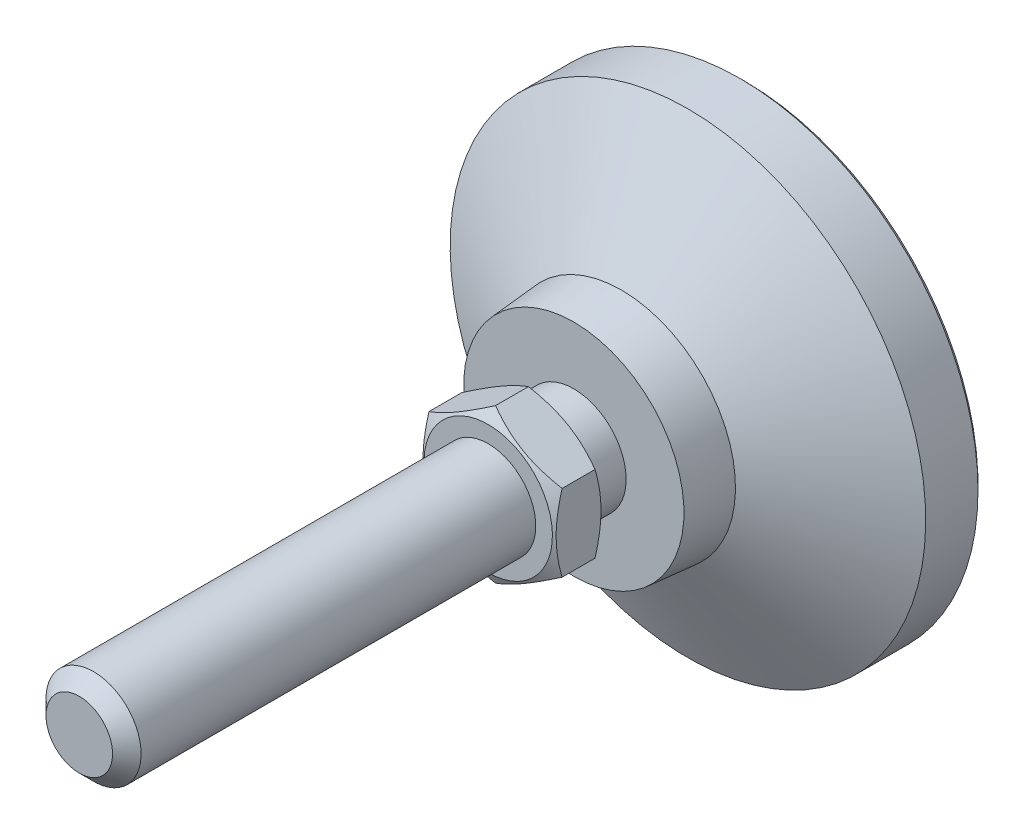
ISO-10303-21;
HEADER;
FILE_DESCRIPTION(('STEP AP214'),'2;1');
FILE_NAME('part.step','',(''),(''),'','','');
FILE_SCHEMA(('AUTOMOTIVE_DESIGN { 1 0 10303 214 1 1 1 1 }'));
ENDSEC;
DATA;
#1=APPLICATION_CONTEXT('core data for automotive mechanical design processes');
#2=APPLICATION_PROTOCOL_DEFINITION('international standard','automotive_design',2000,#1);
#3=PRODUCT_CONTEXT('',#1,'mechanical');
#4=PRODUCT('Part','Part','',(#3));
#5=PRODUCT_RELATED_PRODUCT_CATEGORY('part','',(#4));
#6=PRODUCT_DEFINITION_FORMATION('','',#4);
#7=PRODUCT_DEFINITION_CONTEXT('part definition',#1,'design');
#8=PRODUCT_DEFINITION('design','',#6,#7);
#9=PRODUCT_DEFINITION_SHAPE('','',#8);
#10=(LENGTH_UNIT() NAMED_UNIT(*) SI_UNIT(.MILLI.,.METRE.));
#11=(NAMED_UNIT(*) PLANE_ANGLE_UNIT() SI_UNIT($,.RADIAN.));
#12=(NAMED_UNIT(*) SI_UNIT($,.STERADIAN.) SOLID_ANGLE_UNIT());
#13=UNCERTAINTY_MEASURE_WITH_UNIT(LENGTH_MEASURE(1.E-05),#10,'distance_accuracy_value','');
#14=(GEOMETRIC_REPRESENTATION_CONTEXT(3) GLOBAL_UNCERTAINTY_ASSIGNED_CONTEXT((#13)) GLOBAL_UNIT_ASSIGNED_CONTEXT((#10,
#11,#12)) REPRESENTATION_CONTEXT('',''));
#15=CARTESIAN_POINT('',(0.,0.,0.));
#16=DIRECTION('',(0.,0.,1.));
#17=DIRECTION('',(1.,0.,0.));
#18=AXIS2_PLACEMENT_3D('',#15,#16,#17);
#19=CARTESIAN_POINT('',(0.,0.,-1.));
#20=DIRECTION('',(0.,0.,-1.));
#21=DIRECTION('',(0.,1.,0.));
#22=AXIS2_PLACEMENT_3D('',#19,#20,#21);
#23=CYLINDRICAL_SURFACE('',#22,5.50000000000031);
#24=CARTESIAN_POINT('',(0.,0.,22.));
#25=DIRECTION('',(0.,0.,-1.));
#26=DIRECTION('',(0.,1.,0.));
#27=AXIS2_PLACEMENT_3D('',#24,#25,#26);
#28=CIRCLE('',#27,5.50000000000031);
#29=CARTESIAN_POINT('',(0.,5.50000000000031,22.));
#30=VERTEX_POINT('',#29);
#31=EDGE_CURVE('E106',#30,#30,#28,.T.);
#32=ORIENTED_EDGE('',*,*,#31,.T.);
#33=EDGE_LOOP('',(#32));
#34=FACE_BOUND('',#33,.T.);
#35=CARTESIAN_POINT('',(0.,0.,18.));
#36=DIRECTION('',(0.,0.,-1.));
#37=DIRECTION('',(0.,1.,0.));
#38=AXIS2_PLACEMENT_3D('',#35,#36,#37);
#39=CIRCLE('',#38,5.50000000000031);
#40=CARTESIAN_POINT('',(0.,5.50000000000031,18.));
#41=VERTEX_POINT('',#40);
#42=EDGE_CURVE('E93',#41,#41,#39,.T.);
#43=ORIENTED_EDGE('',*,*,#42,.F.);
#44=EDGE_LOOP('',(#43));
#45=FACE_BOUND('',#44,.T.);
#46=ADVANCED_FACE('F14',(#34,#45),#23,.T.);
#47=CARTESIAN_POINT('',(-5.50000000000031,0.,22.));
#48=DIRECTION('',(0.,0.,1.));
#49=DIRECTION('',(0.,-1.,0.));
#50=AXIS2_PLACEMENT_3D('',#47,#48,#49);
#51=PLANE('',#50);
#52=CARTESIAN_POINT('',(0.,0.,22.));
#53=DIRECTION('',(0.,0.,1.));
#54=DIRECTION('',(0.,-1.,0.));
#55=AXIS2_PLACEMENT_3D('',#52,#53,#54);
#56=CIRCLE('',#55,6.75);
#57=CARTESIAN_POINT('',(0.,-6.75,22.));
#58=VERTEX_POINT('',#57);
#59=EDGE_CURVE('E286',#58,#58,#56,.T.);
#60=ORIENTED_EDGE('',*,*,#59,.F.);
#61=EDGE_LOOP('',(#60));
#62=FACE_BOUND('',#61,.T.);
#63=ORIENTED_EDGE('',*,*,#31,.F.);
#64=EDGE_LOOP('',(#63));
#65=FACE_BOUND('',#64,.T.);
#66=ADVANCED_FACE('F147',(#62,#65),#51,.F.);
#67=CARTESIAN_POINT('',(0.,5.50000000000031,18.));
#68=DIRECTION('',(0.,0.,-1.));
#69=DIRECTION('',(0.,1.,0.));
#70=AXIS2_PLACEMENT_3D('',#67,#68,#69);
#71=PLANE('',#70);
#72=ORIENTED_EDGE('',*,*,#42,.T.);
#73=EDGE_LOOP('',(#72));
#74=FACE_BOUND('',#73,.T.);
#75=CARTESIAN_POINT('',(0.,0.,18.));
#76=DIRECTION('',(0.,0.,-1.));
#77=DIRECTION('',(0.,1.,0.));
#78=AXIS2_PLACEMENT_3D('',#75,#76,#77);
#79=CIRCLE('',#78,11.5833333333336);
#80=CARTESIAN_POINT('',(0.,11.5833333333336,18.));
#81=VERTEX_POINT('',#80);
#82=EDGE_CURVE('E88',#81,#81,#79,.T.);
#83=ORIENTED_EDGE('',*,*,#82,.F.);
#84=EDGE_LOOP('',(#83));
#85=FACE_BOUND('',#84,.T.);
#86=ADVANCED_FACE('F153',(#74,#85),#71,.F.);
#87=CARTESIAN_POINT('',(0.,0.,0.));
#88=DIRECTION('',(0.,0.,1.));
#89=DIRECTION('',(0.,-1.,0.));
#90=AXIS2_PLACEMENT_3D('',#87,#88,#89);
#91=PLANE('',#90);
#92=CARTESIAN_POINT('',(0.,0.,0.));
#93=DIRECTION('',(0.,0.,1.));
#94=DIRECTION('',(0.,-1.,0.));
#95=AXIS2_PLACEMENT_3D('',#92,#93,#94);
#96=CIRCLE('',#95,24.5);
#97=CARTESIAN_POINT('',(0.,-24.5,0.));
#98=VERTEX_POINT('',#97);
#99=EDGE_CURVE('E28',#98,#98,#96,.F.);
#100=ORIENTED_EDGE('',*,*,#99,.T.);
#101=EDGE_LOOP('',(#100));
#102=FACE_BOUND('',#101,.T.);
#103=ADVANCED_FACE('F120',(#102),#91,.F.);
#104=CARTESIAN_POINT('',(0.,0.,-1.));
#105=DIRECTION('',(0.,0.,-1.));
#106=DIRECTION('',(0.,1.,0.));
#107=AXIS2_PLACEMENT_3D('',#104,#105,#106);
#108=CYLINDRICAL_SURFACE('',#107,25.);
#109=CARTESIAN_POINT('',(0.,0.,0.5));
#110=DIRECTION('',(0.,0.,1.));
#111=DIRECTION('',(0.,-1.,0.));
#112=AXIS2_PLACEMENT_3D('',#109,#110,#111);
#113=CIRCLE('',#112,25.);
#114=CARTESIAN_POINT('',(0.,-25.,0.5));
#115=VERTEX_POINT('',#114);
#116=EDGE_CURVE('E114',#115,#115,#113,.T.);
#117=ORIENTED_EDGE('',*,*,#116,.T.);
#118=EDGE_LOOP('',(#117));
#119=FACE_BOUND('',#118,.T.);
#120=CARTESIAN_POINT('',(0.,0.,6.));
#121=DIRECTION('',(0.,0.,-1.));
#122=DIRECTION('',(0.,1.,0.));
#123=AXIS2_PLACEMENT_3D('',#120,#121,#122);
#124=CIRCLE('',#123,25.);
#125=CARTESIAN_POINT('',(0.,25.,6.));
#126=VERTEX_POINT('',#125);
#127=EDGE_CURVE('E112',#126,#126,#124,.T.);
#128=ORIENTED_EDGE('',*,*,#127,.T.);
#129=EDGE_LOOP('',(#128));
#130=FACE_BOUND('',#129,.T.);
#131=ADVANCED_FACE('F127',(#119,#130),#108,.T.);
#132=CARTESIAN_POINT('',(0.,0.,13.));
#133=DIRECTION('',(0.,0.,-1.));
#134=DIRECTION('',(0.,1.,0.));
#135=AXIS2_PLACEMENT_3D('',#132,#133,#134);
#136=CONICAL_SURFACE('',#135,12.0000000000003,1.07685495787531);
#137=ORIENTED_EDGE('',*,*,#127,.F.);
#138=EDGE_LOOP('',(#137));
#139=FACE_BOUND('',#138,.T.);
#140=CARTESIAN_POINT('',(0.,0.,13.));
#141=DIRECTION('',(0.,0.,-1.));
#142=DIRECTION('',(0.,1.,0.));
#143=AXIS2_PLACEMENT_3D('',#140,#141,#142);
#144=CIRCLE('',#143,12.0000000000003);
#145=CARTESIAN_POINT('',(0.,12.0000000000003,13.));
#146=VERTEX_POINT('',#145);
#147=EDGE_CURVE('E109',#146,#146,#144,.T.);
#148=ORIENTED_EDGE('',*,*,#147,.T.);
#149=EDGE_LOOP('',(#148));
#150=FACE_BOUND('',#149,.T.);
#151=ADVANCED_FACE('F130',(#139,#150),#136,.T.);
#152=CARTESIAN_POINT('',(0.,0.,19.));
#153=DIRECTION('',(0.,0.,-1.));
#154=DIRECTION('',(0.,1.,0.));
#155=AXIS2_PLACEMENT_3D('',#152,#153,#154);
#156=CONICAL_SURFACE('',#155,11.5000000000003,0.0831412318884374);
#157=ORIENTED_EDGE('',*,*,#82,.T.);
#158=EDGE_LOOP('',(#157));
#159=FACE_BOUND('',#158,.T.);
#160=ORIENTED_EDGE('',*,*,#147,.F.);
#161=EDGE_LOOP('',(#160));
#162=FACE_BOUND('',#161,.T.);
#163=ADVANCED_FACE('F124',(#159,#162),#156,.T.);
#164=CARTESIAN_POINT('',(0.,0.,0.5));
#165=DIRECTION('',(0.,0.,1.));
#166=DIRECTION('',(0.,-1.,0.));
#167=AXIS2_PLACEMENT_3D('',#164,#165,#166);
#168=CONICAL_SURFACE('',#167,25.,0.785398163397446);
#169=ORIENTED_EDGE('',*,*,#99,.F.);
#170=EDGE_LOOP('',(#169));
#171=FACE_BOUND('',#170,.T.);
#172=ORIENTED_EDGE('',*,*,#116,.F.);
#173=EDGE_LOOP('',(#172));
#174=FACE_BOUND('',#173,.T.);
#175=ADVANCED_FACE('F16',(#171,#174),#168,.T.);
#176=CARTESIAN_POINT('',(0.,0.,22.));
#177=DIRECTION('',(0.,0.,1.));
#178=DIRECTION('',(0.,-1.,0.));
#179=AXIS2_PLACEMENT_3D('',#176,#177,#178);
#180=CONICAL_SURFACE('',#179,6.75,1.0471975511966);
#181=CARTESIAN_POINT('',(0.000200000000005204,-8.08301923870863,22.7696190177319));
#182=CARTESIAN_POINT('',(-0.15366790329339,-7.99418356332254,22.7183374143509));
#183=CARTESIAN_POINT('',(-0.30810950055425,-7.90501666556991,22.669383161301));
#184=CARTESIAN_POINT('',(-0.618246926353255,-7.72595873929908,22.5767703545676));
#185=CARTESIAN_POINT('',(-0.773943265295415,-7.63606741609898,22.5331140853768));
#186=CARTESIAN_POINT('',(-1.24352516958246,-7.36495417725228,22.4109491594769));
#187=CARTESIAN_POINT('',(-1.5592643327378,-7.18266208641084,22.3414631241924));
#188=CARTESIAN_POINT('',(-2.03176224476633,-6.90986528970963,22.2599825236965));
#189=CARTESIAN_POINT('',(-2.18710922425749,-6.82017566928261,22.2367710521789));
#190=CARTESIAN_POINT('',(-2.49850511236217,-6.64039116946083,22.1978487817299));
#191=CARTESIAN_POINT('',(-2.65455395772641,-6.55029632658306,22.1821373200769));
#192=CARTESIAN_POINT('',(-2.96692267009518,-6.36995016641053,22.1586154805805));
#193=CARTESIAN_POINT('',(-3.12324202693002,-6.27969914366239,22.1507961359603));
#194=CARTESIAN_POINT('',(-3.43601650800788,-6.09911871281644,22.1432178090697));
#195=CARTESIAN_POINT('',(-3.59247162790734,-6.00878930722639,22.1434585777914));
#196=CARTESIAN_POINT('',(-4.02110687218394,-5.76131663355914,22.155197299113));
#197=CARTESIAN_POINT('',(-4.2931466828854,-5.60425437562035,22.1749033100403));
#198=CARTESIAN_POINT('',(-4.8354194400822,-5.29117305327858,22.2373910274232));
#199=CARTESIAN_POINT('',(-5.10565047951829,-5.13515508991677,22.2801940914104));
#200=CARTESIAN_POINT('',(-5.64901454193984,-4.82144370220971,22.3871892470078));
#201=CARTESIAN_POINT('',(-5.92207900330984,-4.66378986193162,22.4518346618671));
#202=CARTESIAN_POINT('',(-6.46413578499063,-4.35083323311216,22.5985536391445));
#203=CARTESIAN_POINT('',(-6.73313504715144,-4.1955264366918,22.680592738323));
#204=CARTESIAN_POINT('',(-7.0002,-4.04133641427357,22.7696190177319));
#205=B_SPLINE_CURVE_WITH_KNOTS('',3,(#181,#182,#183,#184,#185,#186,#187,#188,#189,#190,#191,
#192,#193,#194,#195,#196,#197,#198,#199,#200,#201,#202,#203,#204),.UNSPECIFIED.,.F.,.F.,(4,2,2,
2,2,2,2,2,2,2,2,4),(0.,0.554727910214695,1.10969417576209,2.2219327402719,2.76443041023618,
3.30688013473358,3.84871284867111,4.3905288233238,5.33376515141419,6.27787517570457,
7.2429241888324,8.20607866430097),.UNSPECIFIED.);
#206=CARTESIAN_POINT('',(0.,-8.08290376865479,22.7695523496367));
#207=VERTEX_POINT('',#206);
#208=CARTESIAN_POINT('',(-7.,-4.04145188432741,22.7695523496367));
#209=VERTEX_POINT('',#208);
#210=EDGE_CURVE('E73',#207,#209,#205,.T.);
#211=ORIENTED_EDGE('',*,*,#210,.T.);
#212=CARTESIAN_POINT('',(-7.,10.8343435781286,25.5500999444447));
#213=CARTESIAN_POINT('',(-7.,10.5287862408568,25.4019637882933));
#214=CARTESIAN_POINT('',(-7.,10.2225251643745,25.2552542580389));
#215=CARTESIAN_POINT('',(-7.,9.60822118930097,24.9654912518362));
#216=CARTESIAN_POINT('',(-7.,9.30017801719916,24.8224383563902));
#217=CARTESIAN_POINT('',(-7.,8.68033806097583,24.540067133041));
#218=CARTESIAN_POINT('',(-7.,8.36852995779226,24.4007735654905));
#219=CARTESIAN_POINT('',(-7.,7.74242624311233,24.1279156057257));
#220=CARTESIAN_POINT('',(-7.,7.42813075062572,23.9943509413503));
#221=CARTESIAN_POINT('',(-7.,6.78649223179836,23.7303245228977));
#222=CARTESIAN_POINT('',(-7.,6.45905233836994,23.6000968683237));
#223=CARTESIAN_POINT('',(-7.,5.8003345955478,23.3495497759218));
#224=CARTESIAN_POINT('',(-7.,5.469056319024,23.2292314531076));
#225=CARTESIAN_POINT('',(-7.,4.80275777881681,23.0016777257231));
#226=CARTESIAN_POINT('',(-7.,4.46774672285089,22.8944156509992));
#227=CARTESIAN_POINT('',(-7.,3.79293127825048,22.6964289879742));
#228=CARTESIAN_POINT('',(-7.,3.45312844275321,22.6056991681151));
#229=CARTESIAN_POINT('',(-7.,2.77036090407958,22.4456325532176));
#230=CARTESIAN_POINT('',(-7.,2.42742394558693,22.3761806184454));
#231=CARTESIAN_POINT('',(-7.,1.909912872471,22.290978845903));
#232=CARTESIAN_POINT('',(-7.,1.73687870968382,22.2657397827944));
#233=CARTESIAN_POINT('',(-7.,1.38995764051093,22.2220825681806));
#234=CARTESIAN_POINT('',(-7.,1.21607081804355,22.2036637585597));
#235=CARTESIAN_POINT('',(-7.,0.869939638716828,22.1742438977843));
#236=CARTESIAN_POINT('',(-7.,0.697703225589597,22.1631497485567));
#237=CARTESIAN_POINT('',(-7.,0.352915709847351,22.1482534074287));
#238=CARTESIAN_POINT('',(-7.,0.180364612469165,22.1444510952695));
#239=CARTESIAN_POINT('',(-7.,-0.164744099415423,22.1442290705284));
#240=CARTESIAN_POINT('',(-7.,-0.337301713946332,22.1478093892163));
#241=CARTESIAN_POINT('',(-7.,-0.682113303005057,22.1622655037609));
#242=CARTESIAN_POINT('',(-7.,-0.854367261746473,22.1731416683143));
#243=CARTESIAN_POINT('',(-7.,-1.26899790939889,22.2078732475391));
#244=CARTESIAN_POINT('',(-7.,-1.51108771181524,22.2352264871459));
#245=CARTESIAN_POINT('',(-7.,-1.99344500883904,22.3028464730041));
#246=CARTESIAN_POINT('',(-7.,-2.23371224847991,22.3431149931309));
#247=CARTESIAN_POINT('',(-7.,-2.95151967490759,22.4811560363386));
#248=CARTESIAN_POINT('',(-7.,-3.42579265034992,22.5961381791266));
#249=CARTESIAN_POINT('',(-7.,-4.1349310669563,22.7952090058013));
#250=CARTESIAN_POINT('',(-7.,-4.37348275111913,22.8669188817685));
#251=CARTESIAN_POINT('',(-7.,-4.84826856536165,23.0177073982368));
#252=CARTESIAN_POINT('',(-7.,-5.08450268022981,23.0967860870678));
#253=CARTESIAN_POINT('',(-7.,-5.55472921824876,23.2610500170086));
#254=CARTESIAN_POINT('',(-7.,-5.7887223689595,23.3462331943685));
#255=CARTESIAN_POINT('',(-7.,-6.25477527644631,23.5217117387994));
#256=CARTESIAN_POINT('',(-7.,-6.48683505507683,23.6120070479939));
#257=CARTESIAN_POINT('',(-7.,-7.03129228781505,23.8296625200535));
#258=CARTESIAN_POINT('',(-7.,-7.34297589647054,23.9588049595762));
#259=CARTESIAN_POINT('',(-7.,-7.96372128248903,24.2232621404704));
#260=CARTESIAN_POINT('',(-7.,-8.27278290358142,24.3585772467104));
#261=CARTESIAN_POINT('',(-7.,-8.88876246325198,24.6341489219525));
#262=CARTESIAN_POINT('',(-7.,-9.19567996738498,24.774406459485));
#263=CARTESIAN_POINT('',(-7.,-9.80767769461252,25.0588812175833));
#264=CARTESIAN_POINT('',(-7.,-10.1127578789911,25.2030985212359));
#265=CARTESIAN_POINT('',(-7.,-10.7216927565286,25.4949044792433));
#266=CARTESIAN_POINT('',(-7.,-11.0255458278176,25.6424965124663));
#267=CARTESIAN_POINT('',(-7.,-11.6319487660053,25.9403363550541));
#268=CARTESIAN_POINT('',(-7.,-11.9344986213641,26.0905841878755));
#269=CARTESIAN_POINT('',(-7.,-12.8404241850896,26.5445702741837));
#270=CARTESIAN_POINT('',(-7.,-13.4421554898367,26.8515895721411));
#271=CARTESIAN_POINT('',(-7.,-14.5925932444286,27.4460452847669));
#272=CARTESIAN_POINT('',(-7.,-15.1415542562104,27.7329912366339));
#273=CARTESIAN_POINT('',(-7.,-16.2374344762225,28.3107986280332));
#274=CARTESIAN_POINT('',(-7.,-16.7843536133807,28.6016602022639));
#275=CARTESIAN_POINT('',(-7.,-17.8752585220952,29.1856519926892));
#276=CARTESIAN_POINT('',(-7.,-18.419248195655,29.4787749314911));
#277=CARTESIAN_POINT('',(-7.,-19.5059203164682,30.0673649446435));
#278=CARTESIAN_POINT('',(-7.,-20.0486028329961,30.3628318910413));
#279=CARTESIAN_POINT('',(-7.,-20.5908033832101,30.6591747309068));
#280=B_SPLINE_CURVE_WITH_KNOTS('',3,(#212,#213,#214,#215,#216,#217,#218,#219,#220,#221,#222,
#223,#224,#225,#226,#227,#228,#229,#230,#231,#232,#233,#234,#235,#236,#237,#238,#239,#240,#241,
#242,#243,#244,#245,#246,#247,#248,#249,#250,#251,#252,#253,#254,#255,#256,#257,#258,#259,#260,
#261,#262,#263,#264,#265,#266,#267,#268,#269,#270,#271,#272,#273,#274,#275,#276,#277,#278,#279),
.UNSPECIFIED.,.F.,.F.,(4,2,2,2,2,2,2,2,2,2,2,2,2,2,2,2,2,2,2,2,2,2,2,2,2,2,2,2,2,2,2,2,2,4),(0.,
1.0187305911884,2.03762191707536,3.06209657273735,4.08652250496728,5.14355705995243,
6.20071039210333,7.25566667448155,8.31028853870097,9.35909846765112,9.88358073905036,
10.408012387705,10.9256430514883,11.4432651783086,11.9608894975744,12.4785399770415,
13.2090173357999,13.9395950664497,15.4015692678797,16.148798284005,16.8960322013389,
17.6430146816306,18.3899887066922,19.4020357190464,20.4141426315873,21.4264489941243,
22.4387766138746,23.4521665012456,24.4655653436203,26.4920978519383,28.3503774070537,
30.2087210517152,32.0625251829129,33.9162288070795),.UNSPECIFIED.);
#281=CARTESIAN_POINT('',(-7.,4.04145188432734,22.7695523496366));
#282=VERTEX_POINT('',#281);
#283=EDGE_CURVE('E81',#209,#282,#280,.F.);
#284=ORIENTED_EDGE('',*,*,#283,.T.);
#285=CARTESIAN_POINT('',(-7.0002,4.0413364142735,22.7696190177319));
#286=CARTESIAN_POINT('',(-6.84633209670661,4.13017208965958,22.7183374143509));
#287=CARTESIAN_POINT('',(-6.69189049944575,4.21933898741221,22.669383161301));
#288=CARTESIAN_POINT('',(-6.38175307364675,4.39839691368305,22.5767703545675));
#289=CARTESIAN_POINT('',(-6.22605673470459,4.48828823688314,22.5331140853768));
#290=CARTESIAN_POINT('',(-5.75647483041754,4.75940147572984,22.4109491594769));
#291=CARTESIAN_POINT('',(-5.44073566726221,4.94169356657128,22.3414631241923));
#292=CARTESIAN_POINT('',(-4.96823775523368,5.21449036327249,22.2599825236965));
#293=CARTESIAN_POINT('',(-4.81289077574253,5.3041799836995,22.2367710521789));
#294=CARTESIAN_POINT('',(-4.50149488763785,5.48396448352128,22.1978487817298));
#295=CARTESIAN_POINT('',(-4.34544604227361,5.57405932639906,22.1821373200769));
#296=CARTESIAN_POINT('',(-4.03307732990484,5.75440548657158,22.1586154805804));
#297=CARTESIAN_POINT('',(-3.87675797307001,5.84465650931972,22.1507961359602));
#298=CARTESIAN_POINT('',(-3.56398349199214,6.02523694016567,22.1432178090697));
#299=CARTESIAN_POINT('',(-3.40752837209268,6.11556634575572,22.1434585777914));
#300=CARTESIAN_POINT('',(-2.97889312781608,6.36303901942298,22.155197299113));
#301=CARTESIAN_POINT('',(-2.70685331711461,6.52010127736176,22.1749033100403));
#302=CARTESIAN_POINT('',(-2.16458055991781,6.83318259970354,22.2373910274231));
#303=CARTESIAN_POINT('',(-1.89434952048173,6.98920056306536,22.2801940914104));
#304=CARTESIAN_POINT('',(-1.35098545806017,7.30291195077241,22.3871892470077));
#305=CARTESIAN_POINT('',(-1.07792099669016,7.4605657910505,22.451834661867));
#306=CARTESIAN_POINT('',(-0.535864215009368,7.77352241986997,22.5985536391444));
#307=CARTESIAN_POINT('',(-0.266864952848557,7.92882921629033,22.6805927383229));
#308=CARTESIAN_POINT('',(0.000200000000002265,8.08301923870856,22.7696190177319));
#309=B_SPLINE_CURVE_WITH_KNOTS('',3,(#285,#286,#287,#288,#289,#290,#291,#292,#293,#294,#295,
#296,#297,#298,#299,#300,#301,#302,#303,#304,#305,#306,#307,#308),.UNSPECIFIED.,.F.,.F.,(4,2,2,
2,2,2,2,2,2,2,2,4),(0.,0.554727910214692,1.10969417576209,2.22193274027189,2.76443041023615,
3.30688013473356,3.84871284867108,4.39052882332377,5.33376515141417,6.27787517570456,
7.2429241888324,8.20607866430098),.UNSPECIFIED.);
#310=CARTESIAN_POINT('',(0.,8.08290376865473,22.7695523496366));
#311=VERTEX_POINT('',#310);
#312=EDGE_CURVE('E225',#282,#311,#309,.T.);
#313=ORIENTED_EDGE('',*,*,#312,.T.);
#314=CARTESIAN_POINT('',(-0.00019999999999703,8.08301923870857,22.7696190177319));
#315=CARTESIAN_POINT('',(0.153667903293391,7.99418356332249,22.7183374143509));
#316=CARTESIAN_POINT('',(0.308109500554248,7.90501666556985,22.669383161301));
#317=CARTESIAN_POINT('',(0.618246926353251,7.72595873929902,22.5767703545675));
#318=CARTESIAN_POINT('',(0.773943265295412,7.63606741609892,22.5331140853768));
#319=CARTESIAN_POINT('',(1.24352516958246,7.36495417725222,22.4109491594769));
#320=CARTESIAN_POINT('',(1.55926433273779,7.18266208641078,22.3414631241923));
#321=CARTESIAN_POINT('',(2.03176224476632,6.90986528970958,22.2599825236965));
#322=CARTESIAN_POINT('',(2.18710922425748,6.82017566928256,22.2367710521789));
#323=CARTESIAN_POINT('',(2.49850511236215,6.64039116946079,22.1978487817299));
#324=CARTESIAN_POINT('',(2.6545539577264,6.55029632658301,22.1821373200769));
#325=CARTESIAN_POINT('',(2.96692267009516,6.36995016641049,22.1586154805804));
#326=CARTESIAN_POINT('',(3.12324202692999,6.27969914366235,22.1507961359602));
#327=CARTESIAN_POINT('',(3.43601650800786,6.09911871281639,22.1432178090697));
#328=CARTESIAN_POINT('',(3.59247162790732,6.00878930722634,22.1434585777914));
#329=CARTESIAN_POINT('',(4.02110687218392,5.76131663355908,22.155197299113));
#330=CARTESIAN_POINT('',(4.29314668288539,5.6042543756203,22.1749033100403));
#331=CARTESIAN_POINT('',(4.83541944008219,5.29117305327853,22.2373910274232));
#332=CARTESIAN_POINT('',(5.10565047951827,5.13515508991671,22.2801940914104));
#333=CARTESIAN_POINT('',(5.64901454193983,4.82144370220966,22.3871892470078));
#334=CARTESIAN_POINT('',(5.92207900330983,4.66378986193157,22.4518346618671));
#335=CARTESIAN_POINT('',(6.46413578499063,4.3508332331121,22.5985536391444));
#336=CARTESIAN_POINT('',(6.73313504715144,4.19552643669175,22.680592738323));
#337=CARTESIAN_POINT('',(7.0002,4.04133641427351,22.7696190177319));
#338=B_SPLINE_CURVE_WITH_KNOTS('',3,(#314,#315,#316,#317,#318,#319,#320,#321,#322,#323,#324,
#325,#326,#327,#328,#329,#330,#331,#332,#333,#334,#335,#336,#337),.UNSPECIFIED.,.F.,.F.,(4,2,2,
2,2,2,2,2,2,2,2,4),(0.,0.554727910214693,1.10969417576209,2.22193274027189,2.76443041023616,
3.30688013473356,3.84871284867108,4.39052882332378,5.33376515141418,6.27787517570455,
7.2429241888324,8.20607866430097),.UNSPECIFIED.);
#339=CARTESIAN_POINT('',(7.,4.04145188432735,22.7695523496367));
#340=VERTEX_POINT('',#339);
#341=EDGE_CURVE('E219',#311,#340,#338,.T.);
#342=ORIENTED_EDGE('',*,*,#341,.T.);
#343=CARTESIAN_POINT('',(7.,10.8343435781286,25.5500999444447));
#344=CARTESIAN_POINT('',(7.,10.5287862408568,25.4019637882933));
#345=CARTESIAN_POINT('',(7.,10.2225251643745,25.2552542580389));
#346=CARTESIAN_POINT('',(7.,9.60822118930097,24.9654912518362));
#347=CARTESIAN_POINT('',(7.,9.30017801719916,24.8224383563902));
#348=CARTESIAN_POINT('',(7.,8.68033806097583,24.540067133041));
#349=CARTESIAN_POINT('',(7.,8.36852995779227,24.4007735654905));
#350=CARTESIAN_POINT('',(7.,7.74242624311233,24.1279156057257));
#351=CARTESIAN_POINT('',(7.,7.42813075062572,23.9943509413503));
#352=CARTESIAN_POINT('',(7.,6.78649223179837,23.7303245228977));
#353=CARTESIAN_POINT('',(7.,6.45905233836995,23.6000968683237));
#354=CARTESIAN_POINT('',(7.,5.80033459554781,23.3495497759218));
#355=CARTESIAN_POINT('',(7.,5.469056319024,23.2292314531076));
#356=CARTESIAN_POINT('',(7.,4.80275777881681,23.0016777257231));
#357=CARTESIAN_POINT('',(7.,4.4677467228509,22.8944156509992));
#358=CARTESIAN_POINT('',(7.,3.79293127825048,22.6964289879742));
#359=CARTESIAN_POINT('',(7.,3.45312844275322,22.6056991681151));
#360=CARTESIAN_POINT('',(7.,2.77036090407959,22.4456325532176));
#361=CARTESIAN_POINT('',(7.,2.42742394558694,22.3761806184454));
#362=CARTESIAN_POINT('',(7.,1.909912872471,22.290978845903));
#363=CARTESIAN_POINT('',(7.,1.73687870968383,22.2657397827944));
#364=CARTESIAN_POINT('',(7.,1.38995764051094,22.2220825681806));
#365=CARTESIAN_POINT('',(7.,1.21607081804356,22.2036637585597));
#366=CARTESIAN_POINT('',(7.,0.869939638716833,22.1742438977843));
#367=CARTESIAN_POINT('',(7.,0.697703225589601,22.1631497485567));
#368=CARTESIAN_POINT('',(7.,0.352915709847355,22.1482534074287));
#369=CARTESIAN_POINT('',(7.,0.180364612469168,22.1444510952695));
#370=CARTESIAN_POINT('',(7.,-0.16474409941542,22.1442290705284));
#371=CARTESIAN_POINT('',(7.,-0.33730171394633,22.1478093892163));
#372=CARTESIAN_POINT('',(7.,-0.682113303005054,22.1622655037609));
#373=CARTESIAN_POINT('',(7.,-0.85436726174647,22.1731416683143));
#374=CARTESIAN_POINT('',(7.,-1.26899790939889,22.2078732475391));
#375=CARTESIAN_POINT('',(7.,-1.51108771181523,22.2352264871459));
#376=CARTESIAN_POINT('',(7.,-1.99344500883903,22.3028464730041));
#377=CARTESIAN_POINT('',(7.,-2.23371224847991,22.3431149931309));
#378=CARTESIAN_POINT('',(7.,-2.95151967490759,22.4811560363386));
#379=CARTESIAN_POINT('',(7.,-3.42579265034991,22.5961381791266));
#380=CARTESIAN_POINT('',(7.,-4.13493106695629,22.7952090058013));
#381=CARTESIAN_POINT('',(7.,-4.37348275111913,22.8669188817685));
#382=CARTESIAN_POINT('',(7.,-4.84826856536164,23.0177073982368));
#383=CARTESIAN_POINT('',(7.,-5.0845026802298,23.0967860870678));
#384=CARTESIAN_POINT('',(7.,-5.55472921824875,23.2610500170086));
#385=CARTESIAN_POINT('',(7.,-5.7887223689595,23.3462331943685));
#386=CARTESIAN_POINT('',(7.,-6.2547752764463,23.5217117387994));
#387=CARTESIAN_POINT('',(7.,-6.48683505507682,23.6120070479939));
#388=CARTESIAN_POINT('',(7.,-7.03129228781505,23.8296625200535));
#389=CARTESIAN_POINT('',(7.,-7.34297589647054,23.9588049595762));
#390=CARTESIAN_POINT('',(7.,-7.96372128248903,24.2232621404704));
#391=CARTESIAN_POINT('',(7.,-8.27278290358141,24.3585772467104));
#392=CARTESIAN_POINT('',(7.,-8.88876246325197,24.6341489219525));
#393=CARTESIAN_POINT('',(7.,-9.19567996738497,24.774406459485));
#394=CARTESIAN_POINT('',(7.,-9.80767769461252,25.0588812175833));
#395=CARTESIAN_POINT('',(7.,-10.112757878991,25.2030985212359));
#396=CARTESIAN_POINT('',(7.,-10.7216927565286,25.4949044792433));
#397=CARTESIAN_POINT('',(7.,-11.0255458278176,25.6424965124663));
#398=CARTESIAN_POINT('',(7.,-11.6319487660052,25.9403363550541));
#399=CARTESIAN_POINT('',(7.,-11.9344986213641,26.0905841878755));
#400=CARTESIAN_POINT('',(7.,-12.8404241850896,26.5445702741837));
#401=CARTESIAN_POINT('',(7.,-13.4421554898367,26.8515895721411));
#402=CARTESIAN_POINT('',(7.,-14.5925932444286,27.4460452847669));
#403=CARTESIAN_POINT('',(7.,-15.1415542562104,27.7329912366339));
#404=CARTESIAN_POINT('',(7.,-16.2374344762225,28.3107986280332));
#405=CARTESIAN_POINT('',(7.,-16.7843536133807,28.6016602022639));
#406=CARTESIAN_POINT('',(7.,-17.8752585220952,29.1856519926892));
#407=CARTESIAN_POINT('',(7.,-18.419248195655,29.4787749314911));
#408=CARTESIAN_POINT('',(7.,-19.5059203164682,30.0673649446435));
#409=CARTESIAN_POINT('',(7.,-20.0486028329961,30.3628318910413));
#410=CARTESIAN_POINT('',(7.,-20.5908033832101,30.6591747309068));
#411=B_SPLINE_CURVE_WITH_KNOTS('',3,(#343,#344,#345,#346,#347,#348,#349,#350,#351,#352,#353,
#354,#355,#356,#357,#358,#359,#360,#361,#362,#363,#364,#365,#366,#367,#368,#369,#370,#371,#372,
#373,#374,#375,#376,#377,#378,#379,#380,#381,#382,#383,#384,#385,#386,#387,#388,#389,#390,#391,
#392,#393,#394,#395,#396,#397,#398,#399,#400,#401,#402,#403,#404,#405,#406,#407,#408,#409,#410),
.UNSPECIFIED.,.F.,.F.,(4,2,2,2,2,2,2,2,2,2,2,2,2,2,2,2,2,2,2,2,2,2,2,2,2,2,2,2,2,2,2,2,2,4),(0.,
1.0187305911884,2.03762191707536,3.06209657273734,4.08652250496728,5.14355705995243,
6.20071039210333,7.25566667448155,8.31028853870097,9.35909846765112,9.88358073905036,
10.408012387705,10.9256430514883,11.4432651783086,11.9608894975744,12.4785399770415,
13.2090173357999,13.9395950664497,15.4015692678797,16.148798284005,16.8960322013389,
17.6430146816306,18.3899887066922,19.4020357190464,20.4141426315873,21.4264489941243,
22.4387766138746,23.4521665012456,24.4655653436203,26.4920978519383,28.3503774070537,
30.2087210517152,32.0625251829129,33.9162288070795),.UNSPECIFIED.);
#412=CARTESIAN_POINT('',(7.,-4.04145188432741,22.7695523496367));
#413=VERTEX_POINT('',#412);
#414=EDGE_CURVE('E34',#340,#413,#411,.T.);
#415=ORIENTED_EDGE('',*,*,#414,.T.);
#416=CARTESIAN_POINT('',(7.0002,-4.04133641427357,22.7696190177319));
#417=CARTESIAN_POINT('',(6.84633209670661,-4.13017208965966,22.7183374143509));
#418=CARTESIAN_POINT('',(6.69189049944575,-4.21933898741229,22.669383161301));
#419=CARTESIAN_POINT('',(6.38175307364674,-4.39839691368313,22.5767703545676));
#420=CARTESIAN_POINT('',(6.22605673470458,-4.48828823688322,22.5331140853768));
#421=CARTESIAN_POINT('',(5.75647483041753,-4.75940147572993,22.4109491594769));
#422=CARTESIAN_POINT('',(5.44073566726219,-4.94169356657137,22.3414631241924));
#423=CARTESIAN_POINT('',(4.96823775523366,-5.21449036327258,22.2599825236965));
#424=CARTESIAN_POINT('',(4.81289077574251,-5.30417998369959,22.2367710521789));
#425=CARTESIAN_POINT('',(4.50149488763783,-5.48396448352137,22.1978487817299));
#426=CARTESIAN_POINT('',(4.34544604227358,-5.57405932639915,22.1821373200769));
#427=CARTESIAN_POINT('',(4.03307732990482,-5.75440548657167,22.1586154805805));
#428=CARTESIAN_POINT('',(3.87675797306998,-5.84465650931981,22.1507961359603));
#429=CARTESIAN_POINT('',(3.56398349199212,-6.02523694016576,22.1432178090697));
#430=CARTESIAN_POINT('',(3.40752837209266,-6.11556634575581,22.1434585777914));
#431=CARTESIAN_POINT('',(2.97889312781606,-6.36303901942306,22.155197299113));
#432=CARTESIAN_POINT('',(2.7068533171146,-6.52010127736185,22.1749033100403));
#433=CARTESIAN_POINT('',(2.1645805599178,-6.83318259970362,22.2373910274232));
#434=CARTESIAN_POINT('',(1.89434952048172,-6.98920056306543,22.2801940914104));
#435=CARTESIAN_POINT('',(1.35098545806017,-7.30291195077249,22.3871892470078));
#436=CARTESIAN_POINT('',(1.07792099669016,-7.46056579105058,22.4518346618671));
#437=CARTESIAN_POINT('',(0.535864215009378,-7.77352241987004,22.5985536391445));
#438=CARTESIAN_POINT('',(0.266864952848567,-7.9288292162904,22.680592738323));
#439=CARTESIAN_POINT('',(-0.000199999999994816,-8.08301923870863,22.7696190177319));
#440=B_SPLINE_CURVE_WITH_KNOTS('',3,(#416,#417,#418,#419,#420,#421,#422,#423,#424,#425,#426,
#427,#428,#429,#430,#431,#432,#433,#434,#435,#436,#437,#438,#439),.UNSPECIFIED.,.F.,.F.,(4,2,2,
2,2,2,2,2,2,2,2,4),(0.,0.554727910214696,1.10969417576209,2.2219327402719,2.76443041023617,
3.30688013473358,3.8487128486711,4.39052882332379,5.33376515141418,6.27787517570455,
7.24292418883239,8.20607866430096),.UNSPECIFIED.);
#441=EDGE_CURVE('E9',#413,#207,#440,.T.);
#442=ORIENTED_EDGE('',*,*,#441,.T.);
#443=EDGE_LOOP('',(#211,#284,#313,#342,#415,#442));
#444=FACE_BOUND('',#443,.T.);
#445=ORIENTED_EDGE('',*,*,#59,.T.);
#446=EDGE_LOOP('',(#445));
#447=FACE_BOUND('',#446,.T.);
#448=ADVANCED_FACE('F71',(#444,#447),#180,.T.);
#449=CARTESIAN_POINT('',(-3.50000000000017,0.,70.));
#450=DIRECTION('',(0.,0.,-1.));
#451=DIRECTION('',(0.,1.,0.));
#452=AXIS2_PLACEMENT_3D('',#449,#450,#451);
#453=PLANE('',#452);
#454=CARTESIAN_POINT('',(0.,0.,70.));
#455=DIRECTION('',(0.,0.,-1.));
#456=DIRECTION('',(0.,1.,0.));
#457=AXIS2_PLACEMENT_3D('',#454,#455,#456);
#458=CIRCLE('',#457,3.50000000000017);
#459=CARTESIAN_POINT('',(0.,3.50000000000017,70.));
#460=VERTEX_POINT('',#459);
#461=EDGE_CURVE('E97',#460,#460,#458,.T.);
#462=ORIENTED_EDGE('',*,*,#461,.F.);
#463=EDGE_LOOP('',(#462));
#464=FACE_BOUND('',#463,.T.);
#465=ADVANCED_FACE('F170',(#464),#453,.F.);
#466=CARTESIAN_POINT('',(0.,0.,70.));
#467=DIRECTION('',(0.,0.,-1.));
#468=DIRECTION('',(0.,1.,0.));
#469=AXIS2_PLACEMENT_3D('',#466,#467,#468);
#470=CONICAL_SURFACE('',#469,3.50000000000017,0.785398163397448);
#471=CARTESIAN_POINT('',(0.,0.,68.5));
#472=DIRECTION('',(0.,0.,-1.));
#473=DIRECTION('',(0.,1.,0.));
#474=AXIS2_PLACEMENT_3D('',#471,#472,#473);
#475=CIRCLE('',#474,5.00000000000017);
#476=CARTESIAN_POINT('',(0.,5.00000000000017,68.5));
#477=VERTEX_POINT('',#476);
#478=EDGE_CURVE('E100',#477,#477,#475,.T.);
#479=ORIENTED_EDGE('',*,*,#478,.F.);
#480=EDGE_LOOP('',(#479));
#481=FACE_BOUND('',#480,.T.);
#482=ORIENTED_EDGE('',*,*,#461,.T.);
#483=EDGE_LOOP('',(#482));
#484=FACE_BOUND('',#483,.T.);
#485=ADVANCED_FACE('F166',(#481,#484),#470,.T.);
#486=CARTESIAN_POINT('',(0.,0.,-1.));
#487=DIRECTION('',(0.,0.,-1.));
#488=DIRECTION('',(0.,1.,0.));
#489=AXIS2_PLACEMENT_3D('',#486,#487,#488);
#490=CYLINDRICAL_SURFACE('',#489,5.00000000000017);
#491=CARTESIAN_POINT('',(0.,0.,27.));
#492=DIRECTION('',(0.,0.,-1.));
#493=DIRECTION('',(0.,1.,0.));
#494=AXIS2_PLACEMENT_3D('',#491,#492,#493);
#495=CIRCLE('',#494,5.00000000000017);
#496=CARTESIAN_POINT('',(0.,5.00000000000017,27.));
#497=VERTEX_POINT('',#496);
#498=EDGE_CURVE('E103',#497,#497,#495,.T.);
#499=ORIENTED_EDGE('',*,*,#498,.F.);
#500=EDGE_LOOP('',(#499));
#501=FACE_BOUND('',#500,.T.);
#502=ORIENTED_EDGE('',*,*,#478,.T.);
#503=EDGE_LOOP('',(#502));
#504=FACE_BOUND('',#503,.T.);
#505=ADVANCED_FACE('F162',(#501,#504),#490,.T.);
#506=CARTESIAN_POINT('',(-5.00000000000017,0.,27.));
#507=DIRECTION('',(0.,0.,-1.));
#508=DIRECTION('',(0.,1.,0.));
#509=AXIS2_PLACEMENT_3D('',#506,#507,#508);
#510=PLANE('',#509);
#511=CARTESIAN_POINT('',(0.,0.,27.));
#512=DIRECTION('',(0.,0.,1.));
#513=DIRECTION('',(0.,-1.,0.));
#514=AXIS2_PLACEMENT_3D('',#511,#512,#513);
#515=CIRCLE('',#514,6.75);
#516=CARTESIAN_POINT('',(0.,-6.75,27.));
#517=VERTEX_POINT('',#516);
#518=EDGE_CURVE('E80',#517,#517,#515,.T.);
#519=ORIENTED_EDGE('',*,*,#518,.T.);
#520=EDGE_LOOP('',(#519));
#521=FACE_BOUND('',#520,.T.);
#522=ORIENTED_EDGE('',*,*,#498,.T.);
#523=EDGE_LOOP('',(#522));
#524=FACE_BOUND('',#523,.T.);
#525=ADVANCED_FACE('F158',(#521,#524),#510,.F.);
#526=CARTESIAN_POINT('',(0.,0.,25.2542060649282));
#527=DIRECTION('',(0.,0.,-1.));
#528=DIRECTION('',(0.,1.,0.));
#529=AXIS2_PLACEMENT_3D('',#526,#527,#528);
#530=CONICAL_SURFACE('',#529,9.77380379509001,1.0471975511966);
#531=CARTESIAN_POINT('',(-7.0002,-4.04133641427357,26.2303809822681));
#532=CARTESIAN_POINT('',(-6.84633209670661,-4.13017208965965,26.2816625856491));
#533=CARTESIAN_POINT('',(-6.69189049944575,-4.21933898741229,26.330616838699));
#534=CARTESIAN_POINT('',(-6.38175307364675,-4.39839691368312,26.4232296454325));
#535=CARTESIAN_POINT('',(-6.22605673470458,-4.48828823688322,26.4668859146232));
#536=CARTESIAN_POINT('',(-5.75647483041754,-4.75940147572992,26.5890508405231));
#537=CARTESIAN_POINT('',(-5.4407356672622,-4.94169356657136,26.6585368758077));
#538=CARTESIAN_POINT('',(-4.96823775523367,-5.21449036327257,26.7400174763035));
#539=CARTESIAN_POINT('',(-4.81289077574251,-5.30417998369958,26.7632289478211));
#540=CARTESIAN_POINT('',(-4.50149488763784,-5.48396448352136,26.8021512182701));
#541=CARTESIAN_POINT('',(-4.34544604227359,-5.57405932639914,26.8178626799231));
#542=CARTESIAN_POINT('',(-4.03307732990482,-5.75440548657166,26.8413845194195));
#543=CARTESIAN_POINT('',(-3.87675797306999,-5.8446565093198,26.8492038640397));
#544=CARTESIAN_POINT('',(-3.56398349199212,-6.02523694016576,26.8567821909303));
#545=CARTESIAN_POINT('',(-3.40752837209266,-6.11556634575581,26.8565414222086));
#546=CARTESIAN_POINT('',(-2.97889312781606,-6.36303901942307,26.844802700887));
#547=CARTESIAN_POINT('',(-2.7068533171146,-6.52010127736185,26.8250966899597));
#548=CARTESIAN_POINT('',(-2.1645805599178,-6.83318259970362,26.7626089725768));
#549=CARTESIAN_POINT('',(-1.89434952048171,-6.98920056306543,26.7198059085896));
#550=CARTESIAN_POINT('',(-1.35098545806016,-7.30291195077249,26.6128107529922));
#551=CARTESIAN_POINT('',(-1.07792099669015,-7.46056579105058,26.5481653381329));
#552=CARTESIAN_POINT('',(-0.535864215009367,-7.77352241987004,26.4014463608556));
#553=CARTESIAN_POINT('',(-0.266864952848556,-7.9288292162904,26.319407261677));
#554=CARTESIAN_POINT('',(0.00020000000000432,-8.08301923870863,26.2303809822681));
#555=B_SPLINE_CURVE_WITH_KNOTS('',3,(#531,#532,#533,#534,#535,#536,#537,#538,#539,#540,#541,
#542,#543,#544,#545,#546,#547,#548,#549,#550,#551,#552,#553,#554),.UNSPECIFIED.,.F.,.F.,(4,2,2,
2,2,2,2,2,2,2,2,4),(0.,0.554727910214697,1.10969417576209,2.2219327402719,2.76443041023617,
3.30688013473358,3.8487128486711,4.3905288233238,5.33376515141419,6.27787517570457,
7.24292418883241,8.20607866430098),.UNSPECIFIED.);
#556=CARTESIAN_POINT('',(-7.,-4.04145188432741,26.2304476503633));
#557=VERTEX_POINT('',#556);
#558=CARTESIAN_POINT('',(0.,-8.08290376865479,26.2304476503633));
#559=VERTEX_POINT('',#558);
#560=EDGE_CURVE('E182',#557,#559,#555,.T.);
#561=ORIENTED_EDGE('',*,*,#560,.T.);
#562=CARTESIAN_POINT('',(-0.000199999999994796,-8.08301923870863,26.2303809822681));
#563=CARTESIAN_POINT('',(0.153667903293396,-7.99418356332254,26.2816625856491));
#564=CARTESIAN_POINT('',(0.308109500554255,-7.90501666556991,26.330616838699));
#565=CARTESIAN_POINT('',(0.61824692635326,-7.72595873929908,26.4232296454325));
#566=CARTESIAN_POINT('',(0.773943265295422,-7.63606741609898,26.4668859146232));
#567=CARTESIAN_POINT('',(1.24352516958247,-7.36495417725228,26.5890508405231));
#568=CARTESIAN_POINT('',(1.55926433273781,-7.18266208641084,26.6585368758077));
#569=CARTESIAN_POINT('',(2.03176224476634,-6.90986528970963,26.7400174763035));
#570=CARTESIAN_POINT('',(2.18710922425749,-6.82017566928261,26.7632289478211));
#571=CARTESIAN_POINT('',(2.49850511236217,-6.64039116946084,26.8021512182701));
#572=CARTESIAN_POINT('',(2.65455395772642,-6.55029632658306,26.8178626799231));
#573=CARTESIAN_POINT('',(2.96692267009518,-6.36995016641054,26.8413845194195));
#574=CARTESIAN_POINT('',(3.12324202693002,-6.27969914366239,26.8492038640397));
#575=CARTESIAN_POINT('',(3.43601650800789,-6.09911871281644,26.8567821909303));
#576=CARTESIAN_POINT('',(3.59247162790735,-6.00878930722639,26.8565414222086));
#577=CARTESIAN_POINT('',(4.02110687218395,-5.76131663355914,26.844802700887));
#578=CARTESIAN_POINT('',(4.29314668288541,-5.60425437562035,26.8250966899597));
#579=CARTESIAN_POINT('',(4.83541944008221,-5.29117305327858,26.7626089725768));
#580=CARTESIAN_POINT('',(5.10565047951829,-5.13515508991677,26.7198059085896));
#581=CARTESIAN_POINT('',(5.64901454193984,-4.82144370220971,26.6128107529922));
#582=CARTESIAN_POINT('',(5.92207900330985,-4.66378986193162,26.5481653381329));
#583=CARTESIAN_POINT('',(6.46413578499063,-4.35083323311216,26.4014463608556));
#584=CARTESIAN_POINT('',(6.73313504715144,-4.19552643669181,26.319407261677));
#585=CARTESIAN_POINT('',(7.0002,-4.04133641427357,26.2303809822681));
#586=B_SPLINE_CURVE_WITH_KNOTS('',3,(#562,#563,#564,#565,#566,#567,#568,#569,#570,#571,#572,
#573,#574,#575,#576,#577,#578,#579,#580,#581,#582,#583,#584,#585),.UNSPECIFIED.,.F.,.F.,(4,2,2,
2,2,2,2,2,2,2,2,4),(0.,0.554727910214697,1.10969417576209,2.2219327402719,2.76443041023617,
3.30688013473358,3.84871284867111,4.3905288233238,5.3337651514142,6.27787517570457,
7.2429241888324,8.20607866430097),.UNSPECIFIED.);
#587=CARTESIAN_POINT('',(7.,-4.04145188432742,26.2304476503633));
#588=VERTEX_POINT('',#587);
#589=EDGE_CURVE('E86',#559,#588,#586,.T.);
#590=ORIENTED_EDGE('',*,*,#589,.T.);
#591=CARTESIAN_POINT('',(7.,10.8343435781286,23.4499000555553));
#592=CARTESIAN_POINT('',(7.,10.5287862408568,23.5980362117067));
#593=CARTESIAN_POINT('',(7.,10.2225251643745,23.7447457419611));
#594=CARTESIAN_POINT('',(7.,9.60822118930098,24.0345087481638));
#595=CARTESIAN_POINT('',(7.,9.30017801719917,24.1775616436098));
#596=CARTESIAN_POINT('',(7.,8.68033806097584,24.459932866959));
#597=CARTESIAN_POINT('',(7.,8.36852995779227,24.5992264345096));
#598=CARTESIAN_POINT('',(7.,7.74242624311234,24.8720843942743));
#599=CARTESIAN_POINT('',(7.,7.42813075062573,25.0056490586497));
#600=CARTESIAN_POINT('',(7.,6.78649223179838,25.2696754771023));
#601=CARTESIAN_POINT('',(7.,6.45905233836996,25.3999031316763));
#602=CARTESIAN_POINT('',(7.,5.80033459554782,25.6504502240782));
#603=CARTESIAN_POINT('',(7.,5.46905631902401,25.7707685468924));
#604=CARTESIAN_POINT('',(7.,4.80275777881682,25.9983222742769));
#605=CARTESIAN_POINT('',(7.,4.4677467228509,26.1055843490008));
#606=CARTESIAN_POINT('',(7.,3.79293127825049,26.3035710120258));
#607=CARTESIAN_POINT('',(7.,3.45312844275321,26.3943008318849));
#608=CARTESIAN_POINT('',(7.,2.77036090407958,26.5543674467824));
#609=CARTESIAN_POINT('',(7.,2.42742394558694,26.6238193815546));
#610=CARTESIAN_POINT('',(7.,1.909912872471,26.7090211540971));
#611=CARTESIAN_POINT('',(7.,1.73687870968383,26.7342602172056));
#612=CARTESIAN_POINT('',(7.,1.38995764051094,26.7779174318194));
#613=CARTESIAN_POINT('',(7.,1.21607081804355,26.7963362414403));
#614=CARTESIAN_POINT('',(7.,0.869939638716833,26.8257561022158));
#615=CARTESIAN_POINT('',(7.,0.697703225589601,26.8368502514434));
#616=CARTESIAN_POINT('',(7.,0.352915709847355,26.8517465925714));
#617=CARTESIAN_POINT('',(7.,0.180364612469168,26.8555489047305));
#618=CARTESIAN_POINT('',(7.,-0.16474409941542,26.8557709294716));
#619=CARTESIAN_POINT('',(7.,-0.33730171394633,26.8521906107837));
#620=CARTESIAN_POINT('',(7.,-0.682113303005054,26.8377344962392));
#621=CARTESIAN_POINT('',(7.,-0.854367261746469,26.8268583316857));
#622=CARTESIAN_POINT('',(7.,-1.26899790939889,26.7921267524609));
#623=CARTESIAN_POINT('',(7.,-1.51108771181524,26.7647735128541));
#624=CARTESIAN_POINT('',(7.,-1.99344500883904,26.6971535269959));
#625=CARTESIAN_POINT('',(7.,-2.23371224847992,26.6568850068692));
#626=CARTESIAN_POINT('',(7.,-2.9515196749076,26.5188439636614));
#627=CARTESIAN_POINT('',(7.,-3.42579265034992,26.4038618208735));
#628=CARTESIAN_POINT('',(7.,-4.1349310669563,26.2047909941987));
#629=CARTESIAN_POINT('',(7.,-4.37348275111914,26.1330811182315));
#630=CARTESIAN_POINT('',(7.,-4.84826856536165,25.9822926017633));
#631=CARTESIAN_POINT('',(7.,-5.08450268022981,25.9032139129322));
#632=CARTESIAN_POINT('',(7.,-5.55472921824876,25.7389499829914));
#633=CARTESIAN_POINT('',(7.,-5.78872236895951,25.6537668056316));
#634=CARTESIAN_POINT('',(7.,-6.25477527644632,25.4782882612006));
#635=CARTESIAN_POINT('',(7.,-6.48683505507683,25.3879929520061));
#636=CARTESIAN_POINT('',(7.,-7.03129228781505,25.1703374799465));
#637=CARTESIAN_POINT('',(7.,-7.34297589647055,25.0411950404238));
#638=CARTESIAN_POINT('',(7.,-7.96372128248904,24.7767378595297));
#639=CARTESIAN_POINT('',(7.,-8.27278290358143,24.6414227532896));
#640=CARTESIAN_POINT('',(7.,-8.88876246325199,24.3658510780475));
#641=CARTESIAN_POINT('',(7.,-9.19567996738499,24.2255935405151));
#642=CARTESIAN_POINT('',(7.,-9.80767769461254,23.9411187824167));
#643=CARTESIAN_POINT('',(7.,-10.1127578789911,23.7969014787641));
#644=CARTESIAN_POINT('',(7.,-10.7216927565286,23.5050955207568));
#645=CARTESIAN_POINT('',(7.,-11.0255458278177,23.3575034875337));
#646=CARTESIAN_POINT('',(7.,-11.6319487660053,23.0596636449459));
#647=CARTESIAN_POINT('',(7.,-11.9344986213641,22.9094158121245));
#648=CARTESIAN_POINT('',(7.,-12.8404241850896,22.4554297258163));
#649=CARTESIAN_POINT('',(7.,-13.4421554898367,22.1484104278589));
#650=CARTESIAN_POINT('',(7.,-14.5925932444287,21.5539547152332));
#651=CARTESIAN_POINT('',(7.,-15.1415542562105,21.2670087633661));
#652=CARTESIAN_POINT('',(7.,-16.2374344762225,20.6892013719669));
#653=CARTESIAN_POINT('',(7.,-16.7843536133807,20.3983397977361));
#654=CARTESIAN_POINT('',(7.,-17.8752585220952,19.8143480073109));
#655=CARTESIAN_POINT('',(7.,-18.419248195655,19.521225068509));
#656=CARTESIAN_POINT('',(7.,-19.5059203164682,18.9326350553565));
#657=CARTESIAN_POINT('',(7.,-20.0486028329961,18.6371681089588));
#658=CARTESIAN_POINT('',(7.,-20.5908033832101,18.3408252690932));
#659=B_SPLINE_CURVE_WITH_KNOTS('',3,(#591,#592,#593,#594,#595,#596,#597,#598,#599,#600,#601,
#602,#603,#604,#605,#606,#607,#608,#609,#610,#611,#612,#613,#614,#615,#616,#617,#618,#619,#620,
#621,#622,#623,#624,#625,#626,#627,#628,#629,#630,#631,#632,#633,#634,#635,#636,#637,#638,#639,
#640,#641,#642,#643,#644,#645,#646,#647,#648,#649,#650,#651,#652,#653,#654,#655,#656,#657,#658),
.UNSPECIFIED.,.F.,.F.,(4,2,2,2,2,2,2,2,2,2,2,2,2,2,2,2,2,2,2,2,2,2,2,2,2,2,2,2,2,2,2,2,2,4),(0.,
1.0187305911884,2.03762191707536,3.06209657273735,4.08652250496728,5.14355705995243,
6.20071039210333,7.25566667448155,8.31028853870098,9.35909846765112,9.88358073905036,
10.408012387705,10.9256430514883,11.4432651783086,11.9608894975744,12.4785399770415,
13.2090173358,13.9395950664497,15.4015692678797,16.1487982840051,16.8960322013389,
17.6430146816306,18.3899887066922,19.4020357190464,20.4141426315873,21.4264489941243,
22.4387766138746,23.4521665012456,24.4655653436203,26.4920978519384,28.3503774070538,
30.2087210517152,32.0625251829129,33.9162288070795),.UNSPECIFIED.);
#660=CARTESIAN_POINT('',(7.,4.04145188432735,26.2304476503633));
#661=VERTEX_POINT('',#660);
#662=EDGE_CURVE('E275',#588,#661,#659,.F.);
#663=ORIENTED_EDGE('',*,*,#662,.T.);
#664=CARTESIAN_POINT('',(7.0002,4.04133641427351,26.2303809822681));
#665=CARTESIAN_POINT('',(6.84633209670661,4.13017208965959,26.2816625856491));
#666=CARTESIAN_POINT('',(6.69189049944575,4.21933898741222,26.330616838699));
#667=CARTESIAN_POINT('',(6.38175307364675,4.39839691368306,26.4232296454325));
#668=CARTESIAN_POINT('',(6.22605673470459,4.48828823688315,26.4668859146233));
#669=CARTESIAN_POINT('',(5.75647483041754,4.75940147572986,26.5890508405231));
#670=CARTESIAN_POINT('',(5.44073566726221,4.9416935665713,26.6585368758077));
#671=CARTESIAN_POINT('',(4.96823775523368,5.2144903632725,26.7400174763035));
#672=CARTESIAN_POINT('',(4.81289077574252,5.30417998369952,26.7632289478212));
#673=CARTESIAN_POINT('',(4.50149488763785,5.48396448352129,26.8021512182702));
#674=CARTESIAN_POINT('',(4.3454460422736,5.57405932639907,26.8178626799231));
#675=CARTESIAN_POINT('',(4.03307732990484,5.75440548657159,26.8413845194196));
#676=CARTESIAN_POINT('',(3.87675797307,5.84465650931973,26.8492038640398));
#677=CARTESIAN_POINT('',(3.56398349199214,6.02523694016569,26.8567821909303));
#678=CARTESIAN_POINT('',(3.40752837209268,6.11556634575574,26.8565414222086));
#679=CARTESIAN_POINT('',(2.97889312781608,6.363039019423,26.844802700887));
#680=CARTESIAN_POINT('',(2.70685331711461,6.52010127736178,26.8250966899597));
#681=CARTESIAN_POINT('',(2.1645805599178,6.83318259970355,26.7626089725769));
#682=CARTESIAN_POINT('',(1.89434952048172,6.98920056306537,26.7198059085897));
#683=CARTESIAN_POINT('',(1.35098545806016,7.30291195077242,26.6128107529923));
#684=CARTESIAN_POINT('',(1.07792099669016,7.46056579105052,26.548165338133));
#685=CARTESIAN_POINT('',(0.535864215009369,7.77352241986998,26.4014463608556));
#686=CARTESIAN_POINT('',(0.266864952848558,7.92882921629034,26.3194072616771));
#687=CARTESIAN_POINT('',(-0.000199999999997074,8.08301923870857,26.2303809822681));
#688=B_SPLINE_CURVE_WITH_KNOTS('',3,(#664,#665,#666,#667,#668,#669,#670,#671,#672,#673,#674,
#675,#676,#677,#678,#679,#680,#681,#682,#683,#684,#685,#686,#687),.UNSPECIFIED.,.F.,.F.,(4,2,2,
2,2,2,2,2,2,2,2,4),(0.,0.554727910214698,1.10969417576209,2.2219327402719,2.76443041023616,
3.30688013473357,3.84871284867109,4.39052882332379,5.33376515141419,6.27787517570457,
7.24292418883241,8.20607866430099),.UNSPECIFIED.);
#689=CARTESIAN_POINT('',(0.,8.08290376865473,26.2304476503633));
#690=VERTEX_POINT('',#689);
#691=EDGE_CURVE('E249',#661,#690,#688,.T.);
#692=ORIENTED_EDGE('',*,*,#691,.T.);
#693=CARTESIAN_POINT('',(0.000200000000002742,8.08301923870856,26.2303809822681));
#694=CARTESIAN_POINT('',(-0.153667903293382,7.99418356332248,26.2816625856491));
#695=CARTESIAN_POINT('',(-0.308109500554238,7.90501666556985,26.330616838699));
#696=CARTESIAN_POINT('',(-0.61824692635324,7.72595873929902,26.4232296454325));
#697=CARTESIAN_POINT('',(-0.773943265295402,7.63606741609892,26.4668859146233));
#698=CARTESIAN_POINT('',(-1.24352516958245,7.36495417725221,26.5890508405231));
#699=CARTESIAN_POINT('',(-1.55926433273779,7.18266208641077,26.6585368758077));
#700=CARTESIAN_POINT('',(-2.03176224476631,6.90986528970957,26.7400174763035));
#701=CARTESIAN_POINT('',(-2.18710922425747,6.82017566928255,26.7632289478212));
#702=CARTESIAN_POINT('',(-2.49850511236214,6.64039116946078,26.8021512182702));
#703=CARTESIAN_POINT('',(-2.65455395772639,6.550296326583,26.8178626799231));
#704=CARTESIAN_POINT('',(-2.96692267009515,6.36995016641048,26.8413845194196));
#705=CARTESIAN_POINT('',(-3.12324202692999,6.27969914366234,26.8492038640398));
#706=CARTESIAN_POINT('',(-3.43601650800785,6.09911871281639,26.8567821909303));
#707=CARTESIAN_POINT('',(-3.59247162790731,6.00878930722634,26.8565414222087));
#708=CARTESIAN_POINT('',(-4.02110687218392,5.76131663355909,26.844802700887));
#709=CARTESIAN_POINT('',(-4.29314668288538,5.6042543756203,26.8250966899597));
#710=CARTESIAN_POINT('',(-4.83541944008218,5.29117305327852,26.7626089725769));
#711=CARTESIAN_POINT('',(-5.10565047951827,5.1351550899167,26.7198059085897));
#712=CARTESIAN_POINT('',(-5.64901454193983,4.82144370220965,26.6128107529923));
#713=CARTESIAN_POINT('',(-5.92207900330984,4.66378986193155,26.548165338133));
#714=CARTESIAN_POINT('',(-6.46413578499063,4.35083323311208,26.4014463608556));
#715=CARTESIAN_POINT('',(-6.73313504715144,4.19552643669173,26.3194072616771));
#716=CARTESIAN_POINT('',(-7.0002,4.0413364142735,26.2303809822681));
#717=B_SPLINE_CURVE_WITH_KNOTS('',3,(#693,#694,#695,#696,#697,#698,#699,#700,#701,#702,#703,
#704,#705,#706,#707,#708,#709,#710,#711,#712,#713,#714,#715,#716),.UNSPECIFIED.,.F.,.F.,(4,2,2,
2,2,2,2,2,2,2,2,4),(0.,0.554727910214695,1.10969417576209,2.2219327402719,2.76443041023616,
3.30688013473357,3.84871284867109,4.39052882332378,5.33376515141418,6.27787517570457,
7.24292418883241,8.206078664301),.UNSPECIFIED.);
#718=CARTESIAN_POINT('',(-7.,4.04145188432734,26.2304476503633));
#719=VERTEX_POINT('',#718);
#720=EDGE_CURVE('E241',#690,#719,#717,.T.);
#721=ORIENTED_EDGE('',*,*,#720,.T.);
#722=CARTESIAN_POINT('',(-7.,10.8343435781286,23.4499000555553));
#723=CARTESIAN_POINT('',(-7.,10.5287862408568,23.5980362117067));
#724=CARTESIAN_POINT('',(-7.,10.2225251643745,23.7447457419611));
#725=CARTESIAN_POINT('',(-7.,9.60822118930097,24.0345087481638));
#726=CARTESIAN_POINT('',(-7.,9.30017801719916,24.1775616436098));
#727=CARTESIAN_POINT('',(-7.,8.68033806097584,24.459932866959));
#728=CARTESIAN_POINT('',(-7.,8.36852995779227,24.5992264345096));
#729=CARTESIAN_POINT('',(-7.,7.74242624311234,24.8720843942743));
#730=CARTESIAN_POINT('',(-7.,7.42813075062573,25.0056490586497));
#731=CARTESIAN_POINT('',(-7.,6.78649223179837,25.2696754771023));
#732=CARTESIAN_POINT('',(-7.,6.45905233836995,25.3999031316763));
#733=CARTESIAN_POINT('',(-7.,5.80033459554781,25.6504502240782));
#734=CARTESIAN_POINT('',(-7.,5.46905631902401,25.7707685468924));
#735=CARTESIAN_POINT('',(-7.,4.80275777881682,25.9983222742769));
#736=CARTESIAN_POINT('',(-7.,4.4677467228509,26.1055843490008));
#737=CARTESIAN_POINT('',(-7.,3.79293127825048,26.3035710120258));
#738=CARTESIAN_POINT('',(-7.,3.45312844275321,26.3943008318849));
#739=CARTESIAN_POINT('',(-7.,2.77036090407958,26.5543674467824));
#740=CARTESIAN_POINT('',(-7.,2.42742394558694,26.6238193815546));
#741=CARTESIAN_POINT('',(-7.,1.909912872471,26.7090211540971));
#742=CARTESIAN_POINT('',(-7.,1.73687870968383,26.7342602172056));
#743=CARTESIAN_POINT('',(-7.,1.38995764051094,26.7779174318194));
#744=CARTESIAN_POINT('',(-7.,1.21607081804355,26.7963362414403));
#745=CARTESIAN_POINT('',(-7.,0.869939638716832,26.8257561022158));
#746=CARTESIAN_POINT('',(-7.,0.6977032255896,26.8368502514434));
#747=CARTESIAN_POINT('',(-7.,0.352915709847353,26.8517465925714));
#748=CARTESIAN_POINT('',(-7.,0.180364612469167,26.8555489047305));
#749=CARTESIAN_POINT('',(-7.,-0.16474409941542,26.8557709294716));
#750=CARTESIAN_POINT('',(-7.,-0.33730171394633,26.8521906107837));
#751=CARTESIAN_POINT('',(-7.,-0.682113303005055,26.8377344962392));
#752=CARTESIAN_POINT('',(-7.,-0.854367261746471,26.8268583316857));
#753=CARTESIAN_POINT('',(-7.,-1.26899790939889,26.7921267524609));
#754=CARTESIAN_POINT('',(-7.,-1.51108771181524,26.7647735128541));
#755=CARTESIAN_POINT('',(-7.,-1.99344500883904,26.6971535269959));
#756=CARTESIAN_POINT('',(-7.,-2.23371224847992,26.6568850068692));
#757=CARTESIAN_POINT('',(-7.,-2.9515196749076,26.5188439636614));
#758=CARTESIAN_POINT('',(-7.,-3.42579265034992,26.4038618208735));
#759=CARTESIAN_POINT('',(-7.,-4.13493106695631,26.2047909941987));
#760=CARTESIAN_POINT('',(-7.,-4.37348275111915,26.1330811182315));
#761=CARTESIAN_POINT('',(-7.,-4.84826856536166,25.9822926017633));
#762=CARTESIAN_POINT('',(-7.,-5.08450268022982,25.9032139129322));
#763=CARTESIAN_POINT('',(-7.,-5.55472921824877,25.7389499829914));
#764=CARTESIAN_POINT('',(-7.,-5.78872236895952,25.6537668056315));
#765=CARTESIAN_POINT('',(-7.,-6.25477527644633,25.4782882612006));
#766=CARTESIAN_POINT('',(-7.,-6.48683505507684,25.3879929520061));
#767=CARTESIAN_POINT('',(-7.,-7.03129228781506,25.1703374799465));
#768=CARTESIAN_POINT('',(-7.,-7.34297589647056,25.0411950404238));
#769=CARTESIAN_POINT('',(-7.,-7.96372128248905,24.7767378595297));
#770=CARTESIAN_POINT('',(-7.,-8.27278290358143,24.6414227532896));
#771=CARTESIAN_POINT('',(-7.,-8.88876246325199,24.3658510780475));
#772=CARTESIAN_POINT('',(-7.,-9.195679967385,24.2255935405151));
#773=CARTESIAN_POINT('',(-7.,-9.80767769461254,23.9411187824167));
#774=CARTESIAN_POINT('',(-7.,-10.1127578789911,23.7969014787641));
#775=CARTESIAN_POINT('',(-7.,-10.7216927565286,23.5050955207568));
#776=CARTESIAN_POINT('',(-7.,-11.0255458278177,23.3575034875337));
#777=CARTESIAN_POINT('',(-7.,-11.6319487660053,23.0596636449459));
#778=CARTESIAN_POINT('',(-7.,-11.9344986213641,22.9094158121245));
#779=CARTESIAN_POINT('',(-7.,-12.8404241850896,22.4554297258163));
#780=CARTESIAN_POINT('',(-7.,-13.4421554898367,22.1484104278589));
#781=CARTESIAN_POINT('',(-7.,-14.5925932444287,21.5539547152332));
#782=CARTESIAN_POINT('',(-7.,-15.1415542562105,21.2670087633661));
#783=CARTESIAN_POINT('',(-7.,-16.2374344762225,20.6892013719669));
#784=CARTESIAN_POINT('',(-7.,-16.7843536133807,20.3983397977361));
#785=CARTESIAN_POINT('',(-7.,-17.8752585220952,19.8143480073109));
#786=CARTESIAN_POINT('',(-7.,-18.419248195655,19.521225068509));
#787=CARTESIAN_POINT('',(-7.,-19.5059203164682,18.9326350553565));
#788=CARTESIAN_POINT('',(-7.,-20.0486028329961,18.6371681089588));
#789=CARTESIAN_POINT('',(-7.,-20.5908033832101,18.3408252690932));
#790=B_SPLINE_CURVE_WITH_KNOTS('',3,(#722,#723,#724,#725,#726,#727,#728,#729,#730,#731,#732,
#733,#734,#735,#736,#737,#738,#739,#740,#741,#742,#743,#744,#745,#746,#747,#748,#749,#750,#751,
#752,#753,#754,#755,#756,#757,#758,#759,#760,#761,#762,#763,#764,#765,#766,#767,#768,#769,#770,
#771,#772,#773,#774,#775,#776,#777,#778,#779,#780,#781,#782,#783,#784,#785,#786,#787,#788,#789),
.UNSPECIFIED.,.F.,.F.,(4,2,2,2,2,2,2,2,2,2,2,2,2,2,2,2,2,2,2,2,2,2,2,2,2,2,2,2,2,2,2,2,2,4),(0.,
1.0187305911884,2.03762191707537,3.06209657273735,4.08652250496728,5.14355705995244,
6.20071039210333,7.25566667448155,8.31028853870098,9.35909846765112,9.88358073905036,
10.408012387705,10.9256430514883,11.4432651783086,11.9608894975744,12.4785399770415,
13.2090173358,13.9395950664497,15.4015692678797,16.1487982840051,16.8960322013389,
17.6430146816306,18.3899887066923,19.4020357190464,20.4141426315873,21.4264489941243,
22.4387766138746,23.4521665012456,24.4655653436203,26.4920978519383,28.3503774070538,
30.2087210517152,32.0625251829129,33.9162288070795),.UNSPECIFIED.);
#791=EDGE_CURVE('E248',#719,#557,#790,.T.);
#792=ORIENTED_EDGE('',*,*,#791,.T.);
#793=EDGE_LOOP('',(#561,#590,#663,#692,#721,#792));
#794=FACE_BOUND('',#793,.T.);
#795=ORIENTED_EDGE('',*,*,#518,.F.);
#796=EDGE_LOOP('',(#795));
#797=FACE_BOUND('',#796,.T.);
#798=ADVANCED_FACE('F161',(#794,#797),#530,.T.);
#799=CARTESIAN_POINT('',(0.,-8.08290376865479,22.));
#800=DIRECTION('',(0.5,-0.866025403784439,0.));
#801=DIRECTION('',(0.866025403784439,0.5,0.));
#802=AXIS2_PLACEMENT_3D('',#799,#800,#801);
#803=PLANE('',#802);
#804=ORIENTED_EDGE('',*,*,#441,.F.);
#805=DIRECTION('',(0.,0.,1.));
#806=VECTOR('',#805,1.);
#807=CARTESIAN_POINT('',(7.,-4.04145188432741,22.));
#808=LINE('',#807,#806);
#809=EDGE_CURVE('E87',#413,#588,#808,.T.);
#810=ORIENTED_EDGE('',*,*,#809,.T.);
#811=ORIENTED_EDGE('',*,*,#589,.F.);
#812=DIRECTION('',(0.,0.,1.));
#813=VECTOR('',#812,1.);
#814=CARTESIAN_POINT('',(0.,-8.08290376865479,22.));
#815=LINE('',#814,#813);
#816=EDGE_CURVE('E42',#207,#559,#815,.T.);
#817=ORIENTED_EDGE('',*,*,#816,.F.);
#818=EDGE_LOOP('',(#804,#810,#811,#817));
#819=FACE_BOUND('',#818,.T.);
#820=ADVANCED_FACE('F84',(#819),#803,.T.);
#821=CARTESIAN_POINT('',(7.,-4.04145188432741,22.));
#822=DIRECTION('',(1.,0.,0.));
#823=DIRECTION('',(0.,1.,0.));
#824=AXIS2_PLACEMENT_3D('',#821,#822,#823);
#825=PLANE('',#824);
#826=ORIENTED_EDGE('',*,*,#414,.F.);
#827=DIRECTION('',(0.,0.,1.));
#828=VECTOR('',#827,1.);
#829=CARTESIAN_POINT('',(7.,4.04145188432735,22.));
#830=LINE('',#829,#828);
#831=EDGE_CURVE('E90',#340,#661,#830,.T.);
#832=ORIENTED_EDGE('',*,*,#831,.T.);
#833=ORIENTED_EDGE('',*,*,#662,.F.);
#834=ORIENTED_EDGE('',*,*,#809,.F.);
#835=EDGE_LOOP('',(#826,#832,#833,#834));
#836=FACE_BOUND('',#835,.T.);
#837=ADVANCED_FACE('F274',(#836),#825,.T.);
#838=CARTESIAN_POINT('',(7.,4.04145188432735,22.));
#839=DIRECTION('',(0.5,0.866025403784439,0.));
#840=DIRECTION('',(-0.866025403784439,0.5,0.));
#841=AXIS2_PLACEMENT_3D('',#838,#839,#840);
#842=PLANE('',#841);
#843=ORIENTED_EDGE('',*,*,#341,.F.);
#844=DIRECTION('',(0.,0.,1.));
#845=VECTOR('',#844,1.);
#846=CARTESIAN_POINT('',(0.,8.08290376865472,22.));
#847=LINE('',#846,#845);
#848=EDGE_CURVE('E269',#311,#690,#847,.T.);
#849=ORIENTED_EDGE('',*,*,#848,.T.);
#850=ORIENTED_EDGE('',*,*,#691,.F.);
#851=ORIENTED_EDGE('',*,*,#831,.F.);
#852=EDGE_LOOP('',(#843,#849,#850,#851));
#853=FACE_BOUND('',#852,.T.);
#854=ADVANCED_FACE('F234',(#853),#842,.T.);
#855=CARTESIAN_POINT('',(0.,8.08290376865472,22.));
#856=DIRECTION('',(-0.5,0.866025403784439,0.));
#857=DIRECTION('',(-0.866025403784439,-0.5,0.));
#858=AXIS2_PLACEMENT_3D('',#855,#856,#857);
#859=PLANE('',#858);
#860=ORIENTED_EDGE('',*,*,#312,.F.);
#861=DIRECTION('',(0.,0.,1.));
#862=VECTOR('',#861,1.);
#863=CARTESIAN_POINT('',(-7.,4.04145188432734,22.));
#864=LINE('',#863,#862);
#865=EDGE_CURVE('E267',#282,#719,#864,.T.);
#866=ORIENTED_EDGE('',*,*,#865,.T.);
#867=ORIENTED_EDGE('',*,*,#720,.F.);
#868=ORIENTED_EDGE('',*,*,#848,.F.);
#869=EDGE_LOOP('',(#860,#866,#867,#868));
#870=FACE_BOUND('',#869,.T.);
#871=ADVANCED_FACE('F231',(#870),#859,.T.);
#872=CARTESIAN_POINT('',(-7.,4.04145188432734,22.));
#873=DIRECTION('',(-1.,0.,0.));
#874=DIRECTION('',(0.,-1.,0.));
#875=AXIS2_PLACEMENT_3D('',#872,#873,#874);
#876=PLANE('',#875);
#877=ORIENTED_EDGE('',*,*,#283,.F.);
#878=DIRECTION('',(0.,0.,1.));
#879=VECTOR('',#878,1.);
#880=CARTESIAN_POINT('',(-7.,-4.04145188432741,22.));
#881=LINE('',#880,#879);
#882=EDGE_CURVE('E79',#209,#557,#881,.T.);
#883=ORIENTED_EDGE('',*,*,#882,.T.);
#884=ORIENTED_EDGE('',*,*,#791,.F.);
#885=ORIENTED_EDGE('',*,*,#865,.F.);
#886=EDGE_LOOP('',(#877,#883,#884,#885));
#887=FACE_BOUND('',#886,.T.);
#888=ADVANCED_FACE('F177',(#887),#876,.T.);
#889=CARTESIAN_POINT('',(-7.,-4.04145188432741,22.));
#890=DIRECTION('',(-0.5,-0.866025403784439,0.));
#891=DIRECTION('',(0.866025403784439,-0.5,0.));
#892=AXIS2_PLACEMENT_3D('',#889,#890,#891);
#893=PLANE('',#892);
#894=ORIENTED_EDGE('',*,*,#210,.F.);
#895=ORIENTED_EDGE('',*,*,#816,.T.);
#896=ORIENTED_EDGE('',*,*,#560,.F.);
#897=ORIENTED_EDGE('',*,*,#882,.F.);
#898=EDGE_LOOP('',(#894,#895,#896,#897));
#899=FACE_BOUND('',#898,.T.);
#900=ADVANCED_FACE('F78',(#899),#893,.T.);
#901=CLOSED_SHELL('',(#46,#66,#86,#103,#131,#151,#163,#175,#448,#465,#485,#505,#525,#798,#820,
#837,#854,#871,#888,#900));
#902=MANIFOLD_SOLID_BREP('B1',#901);
#903=ADVANCED_BREP_SHAPE_REPRESENTATION('',(#18,#902),#14);
#904=SHAPE_DEFINITION_REPRESENTATION(#9,#903);
ENDSEC;
END-ISO-10303-21;
